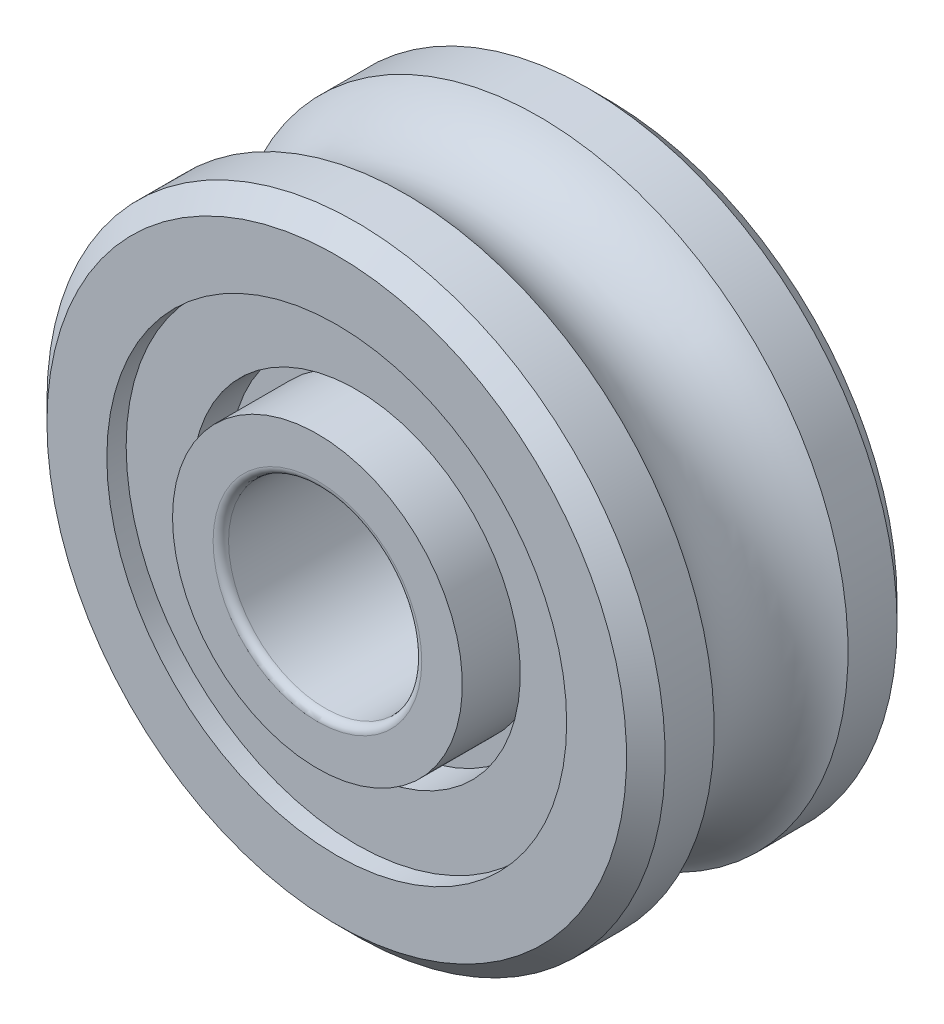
ISO-10303-21;
HEADER;
FILE_DESCRIPTION(('STEP AP214'),'2;1');
FILE_NAME('part.step','',(''),(''),'','','');
FILE_SCHEMA(('AUTOMOTIVE_DESIGN { 1 0 10303 214 1 1 1 1 }'));
ENDSEC;
DATA;
#1=APPLICATION_CONTEXT('core data for automotive mechanical design processes');
#2=APPLICATION_PROTOCOL_DEFINITION('international standard','automotive_design',2000,#1);
#3=PRODUCT_CONTEXT('',#1,'mechanical');
#4=PRODUCT('Part','Part','',(#3));
#5=PRODUCT_RELATED_PRODUCT_CATEGORY('part','',(#4));
#6=PRODUCT_DEFINITION_FORMATION('','',#4);
#7=PRODUCT_DEFINITION_CONTEXT('part definition',#1,'design');
#8=PRODUCT_DEFINITION('design','',#6,#7);
#9=PRODUCT_DEFINITION_SHAPE('','',#8);
#10=(LENGTH_UNIT() NAMED_UNIT(*) SI_UNIT(.MILLI.,.METRE.));
#11=(NAMED_UNIT(*) PLANE_ANGLE_UNIT() SI_UNIT($,.RADIAN.));
#12=(NAMED_UNIT(*) SI_UNIT($,.STERADIAN.) SOLID_ANGLE_UNIT());
#13=UNCERTAINTY_MEASURE_WITH_UNIT(LENGTH_MEASURE(1.E-05),#10,'distance_accuracy_value','');
#14=(GEOMETRIC_REPRESENTATION_CONTEXT(3) GLOBAL_UNCERTAINTY_ASSIGNED_CONTEXT((#13)) GLOBAL_UNIT_ASSIGNED_CONTEXT((#10,
#11,#12)) REPRESENTATION_CONTEXT('',''));
#15=CARTESIAN_POINT('',(0.,0.,0.));
#16=DIRECTION('',(0.,0.,1.));
#17=DIRECTION('',(1.,0.,0.));
#18=AXIS2_PLACEMENT_3D('',#15,#16,#17);
#19=CARTESIAN_POINT('',(0.,3.75,-2.));
#20=DIRECTION('',(0.,0.,1.));
#21=DIRECTION('',(1.,0.,0.));
#22=AXIS2_PLACEMENT_3D('',#19,#20,#21);
#23=PLANE('',#22);
#24=CARTESIAN_POINT('',(0.,0.,-2.));
#25=DIRECTION('',(0.,0.,-1.));
#26=DIRECTION('',(-1.,0.,0.));
#27=AXIS2_PLACEMENT_3D('',#24,#25,#26);
#28=CIRCLE('',#27,4.25);
#29=CARTESIAN_POINT('',(-4.25,0.,-2.));
#30=VERTEX_POINT('',#29);
#31=EDGE_CURVE('E200',#30,#30,#28,.T.);
#32=ORIENTED_EDGE('',*,*,#31,.T.);
#33=EDGE_LOOP('',(#32));
#34=FACE_BOUND('',#33,.T.);
#35=CARTESIAN_POINT('',(0.,0.,-2.));
#36=DIRECTION('',(0.,0.,-1.));
#37=DIRECTION('',(-1.,0.,0.));
#38=AXIS2_PLACEMENT_3D('',#35,#36,#37);
#39=CIRCLE('',#38,3.75);
#40=CARTESIAN_POINT('',(-3.75,0.,-2.));
#41=VERTEX_POINT('',#40);
#42=EDGE_CURVE('E197',#41,#41,#39,.T.);
#43=ORIENTED_EDGE('',*,*,#42,.F.);
#44=EDGE_LOOP('',(#43));
#45=FACE_BOUND('',#44,.T.);
#46=ADVANCED_FACE('F14',(#34,#45),#23,.F.);
#47=CARTESIAN_POINT('',(0.,0.,-38.6779652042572));
#48=DIRECTION('',(0.,0.,-1.));
#49=DIRECTION('',(-1.,0.,0.));
#50=AXIS2_PLACEMENT_3D('',#47,#48,#49);
#51=CYLINDRICAL_SURFACE('',#50,3.75);
#52=CARTESIAN_POINT('',(0.,0.,-4.));
#53=DIRECTION('',(0.,0.,-1.));
#54=DIRECTION('',(-1.,0.,0.));
#55=AXIS2_PLACEMENT_3D('',#52,#53,#54);
#56=CIRCLE('',#55,3.75);
#57=CARTESIAN_POINT('',(-3.75,0.,-4.));
#58=VERTEX_POINT('',#57);
#59=EDGE_CURVE('E203',#58,#58,#56,.F.);
#60=ORIENTED_EDGE('',*,*,#59,.T.);
#61=EDGE_LOOP('',(#60));
#62=FACE_BOUND('',#61,.T.);
#63=ORIENTED_EDGE('',*,*,#42,.T.);
#64=EDGE_LOOP('',(#63));
#65=FACE_BOUND('',#64,.T.);
#66=ADVANCED_FACE('F83',(#62,#65),#51,.T.);
#67=CARTESIAN_POINT('',(0.,0.,-38.6779652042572));
#68=DIRECTION('',(0.,0.,-1.));
#69=DIRECTION('',(-1.,0.,0.));
#70=AXIS2_PLACEMENT_3D('',#67,#68,#69);
#71=CYLINDRICAL_SURFACE('',#70,4.25);
#72=ORIENTED_EDGE('',*,*,#31,.F.);
#73=EDGE_LOOP('',(#72));
#74=FACE_BOUND('',#73,.T.);
#75=CARTESIAN_POINT('',(0.,0.,-3.));
#76=DIRECTION('',(0.,0.,-1.));
#77=DIRECTION('',(-1.,0.,0.));
#78=AXIS2_PLACEMENT_3D('',#75,#76,#77);
#79=CIRCLE('',#78,4.25);
#80=CARTESIAN_POINT('',(-4.25,0.,-3.));
#81=VERTEX_POINT('',#80);
#82=EDGE_CURVE('E54',#81,#81,#79,.T.);
#83=ORIENTED_EDGE('',*,*,#82,.T.);
#84=EDGE_LOOP('',(#83));
#85=FACE_BOUND('',#84,.T.);
#86=ADVANCED_FACE('F72',(#74,#85),#71,.F.);
#87=CARTESIAN_POINT('',(0.,3.75,-4.));
#88=DIRECTION('',(0.,0.,1.));
#89=DIRECTION('',(1.,0.,0.));
#90=AXIS2_PLACEMENT_3D('',#87,#88,#89);
#91=PLANE('',#90);
#92=ORIENTED_EDGE('',*,*,#59,.F.);
#93=EDGE_LOOP('',(#92));
#94=FACE_BOUND('',#93,.T.);
#95=CARTESIAN_POINT('',(0.,0.,-4.));
#96=DIRECTION('',(0.,0.,-1.));
#97=DIRECTION('',(1.,0.,0.));
#98=AXIS2_PLACEMENT_3D('',#95,#96,#97);
#99=CIRCLE('',#98,2.7);
#100=CARTESIAN_POINT('',(2.7,0.,-4.));
#101=VERTEX_POINT('',#100);
#102=CARTESIAN_POINT('',(-2.7,0.,-4.));
#103=VERTEX_POINT('',#102);
#104=EDGE_CURVE('E42',#101,#103,#99,.T.);
#105=ORIENTED_EDGE('',*,*,#104,.F.);
#106=CARTESIAN_POINT('',(0.,0.,-4.));
#107=DIRECTION('',(0.,0.,-1.));
#108=DIRECTION('',(-1.,0.,0.));
#109=AXIS2_PLACEMENT_3D('',#106,#107,#108);
#110=CIRCLE('',#109,2.7);
#111=EDGE_CURVE('E44',#103,#101,#110,.T.);
#112=ORIENTED_EDGE('',*,*,#111,.F.);
#113=EDGE_LOOP('',(#105,#112));
#114=FACE_BOUND('',#113,.T.);
#115=ADVANCED_FACE('F53',(#94,#114),#91,.F.);
#116=CARTESIAN_POINT('',(0.,5.95,-3.));
#117=DIRECTION('',(0.,0.,1.));
#118=DIRECTION('',(1.,0.,0.));
#119=AXIS2_PLACEMENT_3D('',#116,#117,#118);
#120=PLANE('',#119);
#121=CARTESIAN_POINT('',(0.,0.,-3.));
#122=DIRECTION('',(0.,0.,-1.));
#123=DIRECTION('',(-1.,0.,0.));
#124=AXIS2_PLACEMENT_3D('',#121,#122,#123);
#125=CIRCLE('',#124,5.95);
#126=CARTESIAN_POINT('',(-5.95,0.,-3.));
#127=VERTEX_POINT('',#126);
#128=EDGE_CURVE('E49',#127,#127,#125,.T.);
#129=ORIENTED_EDGE('',*,*,#128,.T.);
#130=EDGE_LOOP('',(#129));
#131=FACE_BOUND('',#130,.T.);
#132=ORIENTED_EDGE('',*,*,#82,.F.);
#133=EDGE_LOOP('',(#132));
#134=FACE_BOUND('',#133,.T.);
#135=ADVANCED_FACE('F71',(#131,#134),#120,.F.);
#136=CARTESIAN_POINT('',(0.,0.,-3.8));
#137=DIRECTION('',(0.,0.,-1.));
#138=DIRECTION('',(-1.,0.,0.));
#139=AXIS2_PLACEMENT_3D('',#136,#137,#138);
#140=TOROIDAL_SURFACE('',#139,2.7,0.2);
#141=CARTESIAN_POINT('',(0.,0.,-3.8));
#142=DIRECTION('',(0.,0.,-1.));
#143=DIRECTION('',(-1.,0.,0.));
#144=AXIS2_PLACEMENT_3D('',#141,#142,#143);
#145=CIRCLE('',#144,2.5);
#146=CARTESIAN_POINT('',(-2.5,0.,-3.8));
#147=VERTEX_POINT('',#146);
#148=EDGE_CURVE('E209',#147,#147,#145,.F.);
#149=ORIENTED_EDGE('',*,*,#148,.T.);
#150=EDGE_LOOP('',(#149));
#151=FACE_BOUND('',#150,.T.);
#152=ORIENTED_EDGE('',*,*,#111,.T.);
#153=ORIENTED_EDGE('',*,*,#104,.T.);
#154=EDGE_LOOP('',(#152,#153));
#155=FACE_BOUND('',#154,.T.);
#156=ADVANCED_FACE('F46',(#151,#155),#140,.T.);
#157=CARTESIAN_POINT('',(0.,0.,-38.6779652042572));
#158=DIRECTION('',(0.,0.,-1.));
#159=DIRECTION('',(-1.,0.,0.));
#160=AXIS2_PLACEMENT_3D('',#157,#158,#159);
#161=CYLINDRICAL_SURFACE('',#160,5.95);
#162=ORIENTED_EDGE('',*,*,#128,.F.);
#163=EDGE_LOOP('',(#162));
#164=FACE_BOUND('',#163,.T.);
#165=CARTESIAN_POINT('',(0.,0.,-3.5));
#166=DIRECTION('',(0.,0.,-1.));
#167=DIRECTION('',(-1.,0.,0.));
#168=AXIS2_PLACEMENT_3D('',#165,#166,#167);
#169=CIRCLE('',#168,5.95);
#170=CARTESIAN_POINT('',(-5.95,0.,-3.5));
#171=VERTEX_POINT('',#170);
#172=EDGE_CURVE('E210',#171,#171,#169,.T.);
#173=ORIENTED_EDGE('',*,*,#172,.T.);
#174=EDGE_LOOP('',(#173));
#175=FACE_BOUND('',#174,.T.);
#176=ADVANCED_FACE('F242',(#164,#175),#161,.F.);
#177=CARTESIAN_POINT('',(0.,0.,-38.6779652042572));
#178=DIRECTION('',(0.,0.,-1.));
#179=DIRECTION('',(-1.,0.,0.));
#180=AXIS2_PLACEMENT_3D('',#177,#178,#179);
#181=CYLINDRICAL_SURFACE('',#180,2.5);
#182=CARTESIAN_POINT('',(0.,0.,3.8));
#183=DIRECTION('',(0.,0.,-1.));
#184=DIRECTION('',(-1.,0.,0.));
#185=AXIS2_PLACEMENT_3D('',#182,#183,#184);
#186=CIRCLE('',#185,2.5);
#187=CARTESIAN_POINT('',(-2.5,0.,3.8));
#188=VERTEX_POINT('',#187);
#189=EDGE_CURVE('E213',#188,#188,#186,.T.);
#190=ORIENTED_EDGE('',*,*,#189,.F.);
#191=EDGE_LOOP('',(#190));
#192=FACE_BOUND('',#191,.T.);
#193=ORIENTED_EDGE('',*,*,#148,.F.);
#194=EDGE_LOOP('',(#193));
#195=FACE_BOUND('',#194,.T.);
#196=ADVANCED_FACE('F246',(#192,#195),#181,.F.);
#197=CARTESIAN_POINT('',(0.,7.5,-3.5));
#198=DIRECTION('',(0.,0.,1.));
#199=DIRECTION('',(1.,0.,0.));
#200=AXIS2_PLACEMENT_3D('',#197,#198,#199);
#201=PLANE('',#200);
#202=CARTESIAN_POINT('',(0.,0.,-3.5));
#203=DIRECTION('',(0.,0.,1.));
#204=DIRECTION('',(1.,0.,0.));
#205=AXIS2_PLACEMENT_3D('',#202,#203,#204);
#206=CIRCLE('',#205,7.5);
#207=CARTESIAN_POINT('',(7.5,0.,-3.5));
#208=VERTEX_POINT('',#207);
#209=EDGE_CURVE('E214',#208,#208,#206,.T.);
#210=ORIENTED_EDGE('',*,*,#209,.F.);
#211=EDGE_LOOP('',(#210));
#212=FACE_BOUND('',#211,.T.);
#213=ORIENTED_EDGE('',*,*,#172,.F.);
#214=EDGE_LOOP('',(#213));
#215=FACE_BOUND('',#214,.T.);
#216=ADVANCED_FACE('F180',(#212,#215),#201,.F.);
#217=CARTESIAN_POINT('',(0.,0.,3.8));
#218=DIRECTION('',(0.,0.,-1.));
#219=DIRECTION('',(-1.,0.,0.));
#220=AXIS2_PLACEMENT_3D('',#217,#218,#219);
#221=TOROIDAL_SURFACE('',#220,2.7,0.2);
#222=CARTESIAN_POINT('',(0.,0.,4.));
#223=DIRECTION('',(0.,0.,1.));
#224=DIRECTION('',(-1.,0.,0.));
#225=AXIS2_PLACEMENT_3D('',#222,#223,#224);
#226=CIRCLE('',#225,2.7);
#227=CARTESIAN_POINT('',(-2.7,0.,4.));
#228=VERTEX_POINT('',#227);
#229=CARTESIAN_POINT('',(2.7,0.,4.));
#230=VERTEX_POINT('',#229);
#231=EDGE_CURVE('E143',#228,#230,#226,.T.);
#232=ORIENTED_EDGE('',*,*,#231,.T.);
#233=CARTESIAN_POINT('',(0.,0.,4.));
#234=DIRECTION('',(0.,0.,1.));
#235=DIRECTION('',(1.,0.,0.));
#236=AXIS2_PLACEMENT_3D('',#233,#234,#235);
#237=CIRCLE('',#236,2.7);
#238=EDGE_CURVE('E33',#230,#228,#237,.T.);
#239=ORIENTED_EDGE('',*,*,#238,.T.);
#240=EDGE_LOOP('',(#232,#239));
#241=FACE_BOUND('',#240,.T.);
#242=ORIENTED_EDGE('',*,*,#189,.T.);
#243=EDGE_LOOP('',(#242));
#244=FACE_BOUND('',#243,.T.);
#245=ADVANCED_FACE('F176',(#241,#244),#221,.T.);
#246=CARTESIAN_POINT('',(0.,0.,-3.));
#247=DIRECTION('',(0.,0.,1.));
#248=DIRECTION('',(1.,0.,0.));
#249=AXIS2_PLACEMENT_3D('',#246,#247,#248);
#250=CONICAL_SURFACE('',#249,8.,0.785398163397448);
#251=CARTESIAN_POINT('',(0.,0.,-3.));
#252=DIRECTION('',(0.,0.,-1.));
#253=DIRECTION('',(-1.,0.,0.));
#254=AXIS2_PLACEMENT_3D('',#251,#252,#253);
#255=CIRCLE('',#254,8.);
#256=CARTESIAN_POINT('',(-8.,0.,-3.));
#257=VERTEX_POINT('',#256);
#258=EDGE_CURVE('E165',#257,#257,#255,.F.);
#259=ORIENTED_EDGE('',*,*,#258,.F.);
#260=EDGE_LOOP('',(#259));
#261=FACE_BOUND('',#260,.T.);
#262=ORIENTED_EDGE('',*,*,#209,.T.);
#263=EDGE_LOOP('',(#262));
#264=FACE_BOUND('',#263,.T.);
#265=ADVANCED_FACE('F159',(#261,#264),#250,.T.);
#266=CARTESIAN_POINT('',(0.,3.75,4.));
#267=DIRECTION('',(0.,0.,-1.));
#268=DIRECTION('',(-1.,0.,0.));
#269=AXIS2_PLACEMENT_3D('',#266,#267,#268);
#270=PLANE('',#269);
#271=ORIENTED_EDGE('',*,*,#231,.F.);
#272=ORIENTED_EDGE('',*,*,#238,.F.);
#273=EDGE_LOOP('',(#271,#272));
#274=FACE_BOUND('',#273,.T.);
#275=CARTESIAN_POINT('',(0.,0.,4.));
#276=DIRECTION('',(0.,0.,-1.));
#277=DIRECTION('',(-1.,0.,0.));
#278=AXIS2_PLACEMENT_3D('',#275,#276,#277);
#279=CIRCLE('',#278,3.75);
#280=CARTESIAN_POINT('',(-3.75,0.,4.));
#281=VERTEX_POINT('',#280);
#282=EDGE_CURVE('E141',#281,#281,#279,.T.);
#283=ORIENTED_EDGE('',*,*,#282,.F.);
#284=EDGE_LOOP('',(#283));
#285=FACE_BOUND('',#284,.T.);
#286=ADVANCED_FACE('F148',(#274,#285),#270,.F.);
#287=CARTESIAN_POINT('',(0.,0.,-38.6779652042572));
#288=DIRECTION('',(0.,0.,-1.));
#289=DIRECTION('',(-1.,0.,0.));
#290=AXIS2_PLACEMENT_3D('',#287,#288,#289);
#291=CYLINDRICAL_SURFACE('',#290,8.);
#292=ORIENTED_EDGE('',*,*,#258,.T.);
#293=EDGE_LOOP('',(#292));
#294=FACE_BOUND('',#293,.T.);
#295=CARTESIAN_POINT('',(0.,0.,-1.73205080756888));
#296=DIRECTION('',(0.,0.,-1.));
#297=DIRECTION('',(-1.,0.,0.));
#298=AXIS2_PLACEMENT_3D('',#295,#296,#297);
#299=CIRCLE('',#298,8.);
#300=CARTESIAN_POINT('',(-8.,0.,-1.73205080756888));
#301=VERTEX_POINT('',#300);
#302=EDGE_CURVE('E137',#301,#301,#299,.T.);
#303=ORIENTED_EDGE('',*,*,#302,.T.);
#304=EDGE_LOOP('',(#303));
#305=FACE_BOUND('',#304,.T.);
#306=ADVANCED_FACE('F158',(#294,#305),#291,.T.);
#307=CARTESIAN_POINT('',(0.,0.,-38.6779652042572));
#308=DIRECTION('',(0.,0.,-1.));
#309=DIRECTION('',(-1.,0.,0.));
#310=AXIS2_PLACEMENT_3D('',#307,#308,#309);
#311=CYLINDRICAL_SURFACE('',#310,3.75);
#312=CARTESIAN_POINT('',(0.,0.,2.));
#313=DIRECTION('',(0.,0.,-1.));
#314=DIRECTION('',(-1.,0.,0.));
#315=AXIS2_PLACEMENT_3D('',#312,#313,#314);
#316=CIRCLE('',#315,3.75);
#317=CARTESIAN_POINT('',(-3.75,0.,2.));
#318=VERTEX_POINT('',#317);
#319=EDGE_CURVE('E140',#318,#318,#316,.F.);
#320=ORIENTED_EDGE('',*,*,#319,.T.);
#321=EDGE_LOOP('',(#320));
#322=FACE_BOUND('',#321,.T.);
#323=ORIENTED_EDGE('',*,*,#282,.T.);
#324=EDGE_LOOP('',(#323));
#325=FACE_BOUND('',#324,.T.);
#326=ADVANCED_FACE('F278',(#322,#325),#311,.T.);
#327=CARTESIAN_POINT('',(0.,3.75,2.));
#328=DIRECTION('',(0.,0.,-1.));
#329=DIRECTION('',(-1.,0.,0.));
#330=AXIS2_PLACEMENT_3D('',#327,#328,#329);
#331=PLANE('',#330);
#332=ORIENTED_EDGE('',*,*,#319,.F.);
#333=EDGE_LOOP('',(#332));
#334=FACE_BOUND('',#333,.T.);
#335=CARTESIAN_POINT('',(0.,0.,2.));
#336=DIRECTION('',(0.,0.,-1.));
#337=DIRECTION('',(-1.,0.,0.));
#338=AXIS2_PLACEMENT_3D('',#335,#336,#337);
#339=CIRCLE('',#338,4.25);
#340=CARTESIAN_POINT('',(-4.25,0.,2.));
#341=VERTEX_POINT('',#340);
#342=EDGE_CURVE('E221',#341,#341,#339,.F.);
#343=ORIENTED_EDGE('',*,*,#342,.T.);
#344=EDGE_LOOP('',(#343));
#345=FACE_BOUND('',#344,.T.);
#346=ADVANCED_FACE('F129',(#334,#345),#331,.F.);
#347=CARTESIAN_POINT('',(0.,0.,0.));
#348=DIRECTION('',(0.,0.,-1.));
#349=DIRECTION('',(-1.,0.,0.));
#350=AXIS2_PLACEMENT_3D('',#347,#348,#349);
#351=TOROIDAL_SURFACE('',#350,9.,2.);
#352=ORIENTED_EDGE('',*,*,#302,.F.);
#353=EDGE_LOOP('',(#352));
#354=FACE_BOUND('',#353,.T.);
#355=CARTESIAN_POINT('',(0.,0.,1.73205080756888));
#356=DIRECTION('',(0.,0.,-1.));
#357=DIRECTION('',(-1.,0.,0.));
#358=AXIS2_PLACEMENT_3D('',#355,#356,#357);
#359=CIRCLE('',#358,8.);
#360=CARTESIAN_POINT('',(-8.,0.,1.73205080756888));
#361=VERTEX_POINT('',#360);
#362=EDGE_CURVE('E135',#361,#361,#359,.F.);
#363=ORIENTED_EDGE('',*,*,#362,.F.);
#364=EDGE_LOOP('',(#363));
#365=FACE_BOUND('',#364,.T.);
#366=ADVANCED_FACE('F124',(#354,#365),#351,.F.);
#367=CARTESIAN_POINT('',(0.,0.,-38.6779652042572));
#368=DIRECTION('',(0.,0.,-1.));
#369=DIRECTION('',(-1.,0.,0.));
#370=AXIS2_PLACEMENT_3D('',#367,#368,#369);
#371=CYLINDRICAL_SURFACE('',#370,4.25);
#372=CARTESIAN_POINT('',(0.,0.,3.));
#373=DIRECTION('',(0.,0.,-1.));
#374=DIRECTION('',(-1.,0.,0.));
#375=AXIS2_PLACEMENT_3D('',#372,#373,#374);
#376=CIRCLE('',#375,4.25);
#377=CARTESIAN_POINT('',(-4.25,0.,3.));
#378=VERTEX_POINT('',#377);
#379=EDGE_CURVE('E224',#378,#378,#376,.F.);
#380=ORIENTED_EDGE('',*,*,#379,.T.);
#381=EDGE_LOOP('',(#380));
#382=FACE_BOUND('',#381,.T.);
#383=ORIENTED_EDGE('',*,*,#342,.F.);
#384=EDGE_LOOP('',(#383));
#385=FACE_BOUND('',#384,.T.);
#386=ADVANCED_FACE('F120',(#382,#385),#371,.F.);
#387=CARTESIAN_POINT('',(0.,0.,-38.6779652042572));
#388=DIRECTION('',(0.,0.,-1.));
#389=DIRECTION('',(-1.,0.,0.));
#390=AXIS2_PLACEMENT_3D('',#387,#388,#389);
#391=CYLINDRICAL_SURFACE('',#390,8.);
#392=ORIENTED_EDGE('',*,*,#362,.T.);
#393=EDGE_LOOP('',(#392));
#394=FACE_BOUND('',#393,.T.);
#395=CARTESIAN_POINT('',(0.,0.,3.));
#396=DIRECTION('',(0.,0.,-1.));
#397=DIRECTION('',(-1.,0.,0.));
#398=AXIS2_PLACEMENT_3D('',#395,#396,#397);
#399=CIRCLE('',#398,8.);
#400=CARTESIAN_POINT('',(-8.,0.,3.));
#401=VERTEX_POINT('',#400);
#402=EDGE_CURVE('E227',#401,#401,#399,.F.);
#403=ORIENTED_EDGE('',*,*,#402,.F.);
#404=EDGE_LOOP('',(#403));
#405=FACE_BOUND('',#404,.T.);
#406=ADVANCED_FACE('F116',(#394,#405),#391,.T.);
#407=CARTESIAN_POINT('',(0.,5.95,3.));
#408=DIRECTION('',(0.,0.,-1.));
#409=DIRECTION('',(-1.,0.,0.));
#410=AXIS2_PLACEMENT_3D('',#407,#408,#409);
#411=PLANE('',#410);
#412=ORIENTED_EDGE('',*,*,#379,.F.);
#413=EDGE_LOOP('',(#412));
#414=FACE_BOUND('',#413,.T.);
#415=CARTESIAN_POINT('',(0.,0.,3.));
#416=DIRECTION('',(0.,0.,-1.));
#417=DIRECTION('',(-1.,0.,0.));
#418=AXIS2_PLACEMENT_3D('',#415,#416,#417);
#419=CIRCLE('',#418,5.95);
#420=CARTESIAN_POINT('',(-5.95,0.,3.));
#421=VERTEX_POINT('',#420);
#422=EDGE_CURVE('E228',#421,#421,#419,.F.);
#423=ORIENTED_EDGE('',*,*,#422,.T.);
#424=EDGE_LOOP('',(#423));
#425=FACE_BOUND('',#424,.T.);
#426=ADVANCED_FACE('F112',(#414,#425),#411,.F.);
#427=CARTESIAN_POINT('',(0.,0.,3.));
#428=DIRECTION('',(0.,0.,-1.));
#429=DIRECTION('',(-1.,0.,0.));
#430=AXIS2_PLACEMENT_3D('',#427,#428,#429);
#431=CONICAL_SURFACE('',#430,8.,0.785398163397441);
#432=ORIENTED_EDGE('',*,*,#402,.T.);
#433=EDGE_LOOP('',(#432));
#434=FACE_BOUND('',#433,.T.);
#435=CARTESIAN_POINT('',(0.,0.,3.5));
#436=DIRECTION('',(0.,0.,-1.));
#437=DIRECTION('',(-1.,0.,0.));
#438=AXIS2_PLACEMENT_3D('',#435,#436,#437);
#439=CIRCLE('',#438,7.5);
#440=CARTESIAN_POINT('',(-7.5,0.,3.5));
#441=VERTEX_POINT('',#440);
#442=EDGE_CURVE('E25',#441,#441,#439,.T.);
#443=ORIENTED_EDGE('',*,*,#442,.T.);
#444=EDGE_LOOP('',(#443));
#445=FACE_BOUND('',#444,.T.);
#446=ADVANCED_FACE('F104',(#434,#445),#431,.T.);
#447=CARTESIAN_POINT('',(0.,0.,-38.6779652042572));
#448=DIRECTION('',(0.,0.,-1.));
#449=DIRECTION('',(-1.,0.,0.));
#450=AXIS2_PLACEMENT_3D('',#447,#448,#449);
#451=CYLINDRICAL_SURFACE('',#450,5.95);
#452=CARTESIAN_POINT('',(0.,0.,3.5));
#453=DIRECTION('',(0.,0.,-1.));
#454=DIRECTION('',(-1.,0.,0.));
#455=AXIS2_PLACEMENT_3D('',#452,#453,#454);
#456=CIRCLE('',#455,5.95);
#457=CARTESIAN_POINT('',(-5.95,0.,3.5));
#458=VERTEX_POINT('',#457);
#459=EDGE_CURVE('E9',#458,#458,#456,.F.);
#460=ORIENTED_EDGE('',*,*,#459,.T.);
#461=EDGE_LOOP('',(#460));
#462=FACE_BOUND('',#461,.T.);
#463=ORIENTED_EDGE('',*,*,#422,.F.);
#464=EDGE_LOOP('',(#463));
#465=FACE_BOUND('',#464,.T.);
#466=ADVANCED_FACE('F97',(#462,#465),#451,.F.);
#467=CARTESIAN_POINT('',(0.,7.5,3.5));
#468=DIRECTION('',(0.,0.,-1.));
#469=DIRECTION('',(-1.,0.,0.));
#470=AXIS2_PLACEMENT_3D('',#467,#468,#469);
#471=PLANE('',#470);
#472=ORIENTED_EDGE('',*,*,#459,.F.);
#473=EDGE_LOOP('',(#472));
#474=FACE_BOUND('',#473,.T.);
#475=ORIENTED_EDGE('',*,*,#442,.F.);
#476=EDGE_LOOP('',(#475));
#477=FACE_BOUND('',#476,.T.);
#478=ADVANCED_FACE('F95',(#474,#477),#471,.F.);
#479=CLOSED_SHELL('',(#46,#66,#86,#115,#135,#156,#176,#196,#216,#245,#265,#286,#306,#326,#346,
#366,#386,#406,#426,#446,#466,#478));
#480=MANIFOLD_SOLID_BREP('B1',#479);
#481=ADVANCED_BREP_SHAPE_REPRESENTATION('',(#18,#480),#14);
#482=SHAPE_DEFINITION_REPRESENTATION(#9,#481);
ENDSEC;
END-ISO-10303-21;
